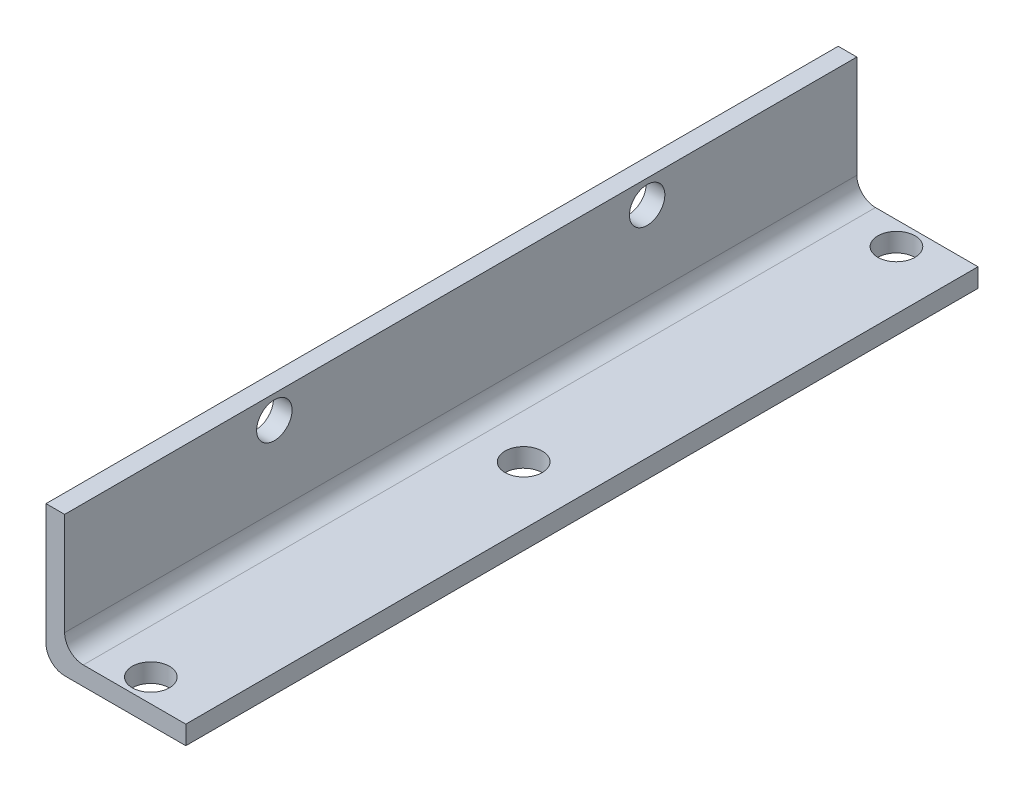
ISO-10303-21;
HEADER;
FILE_DESCRIPTION(('STEP AP214'),'2;1');
FILE_NAME('part.step','',(''),(''),'','','');
FILE_SCHEMA(('AUTOMOTIVE_DESIGN { 1 0 10303 214 1 1 1 1 }'));
ENDSEC;
DATA;
#1=APPLICATION_CONTEXT('core data for automotive mechanical design processes');
#2=APPLICATION_PROTOCOL_DEFINITION('international standard','automotive_design',2000,#1);
#3=PRODUCT_CONTEXT('',#1,'mechanical');
#4=PRODUCT('Part','Part','',(#3));
#5=PRODUCT_RELATED_PRODUCT_CATEGORY('part','',(#4));
#6=PRODUCT_DEFINITION_FORMATION('','',#4);
#7=PRODUCT_DEFINITION_CONTEXT('part definition',#1,'design');
#8=PRODUCT_DEFINITION('design','',#6,#7);
#9=PRODUCT_DEFINITION_SHAPE('','',#8);
#10=(LENGTH_UNIT() NAMED_UNIT(*) SI_UNIT(.MILLI.,.METRE.));
#11=(NAMED_UNIT(*) PLANE_ANGLE_UNIT() SI_UNIT($,.RADIAN.));
#12=(NAMED_UNIT(*) SI_UNIT($,.STERADIAN.) SOLID_ANGLE_UNIT());
#13=UNCERTAINTY_MEASURE_WITH_UNIT(LENGTH_MEASURE(1.E-05),#10,'distance_accuracy_value','');
#14=(GEOMETRIC_REPRESENTATION_CONTEXT(3) GLOBAL_UNCERTAINTY_ASSIGNED_CONTEXT((#13)) GLOBAL_UNIT_ASSIGNED_CONTEXT((#10,
#11,#12)) REPRESENTATION_CONTEXT('',''));
#15=CARTESIAN_POINT('',(0.,0.,0.));
#16=DIRECTION('',(0.,0.,1.));
#17=DIRECTION('',(1.,0.,0.));
#18=AXIS2_PLACEMENT_3D('',#15,#16,#17);
#19=CARTESIAN_POINT('',(0.,38.1,107.95));
#20=DIRECTION('',(1.,0.,0.));
#21=DIRECTION('',(0.,1.,0.));
#22=AXIS2_PLACEMENT_3D('',#19,#20,#21);
#23=PLANE('',#22);
#24=DIRECTION('',(0.,-1.,0.));
#25=VECTOR('',#24,1.);
#26=CARTESIAN_POINT('',(0.,38.1,-107.95));
#27=LINE('',#26,#25);
#28=CARTESIAN_POINT('',(0.,38.1,-107.95));
#29=VERTEX_POINT('',#28);
#30=CARTESIAN_POINT('',(0.,5.08000000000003,-107.95));
#31=VERTEX_POINT('',#30);
#32=EDGE_CURVE('E99',#29,#31,#27,.T.);
#33=ORIENTED_EDGE('',*,*,#32,.T.);
#34=DIRECTION('',(0.,0.,-1.));
#35=VECTOR('',#34,1.);
#36=CARTESIAN_POINT('',(0.,5.08000000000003,107.95));
#37=LINE('',#36,#35);
#38=CARTESIAN_POINT('',(0.,5.08000000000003,107.95));
#39=VERTEX_POINT('',#38);
#40=EDGE_CURVE('E42',#39,#31,#37,.T.);
#41=ORIENTED_EDGE('',*,*,#40,.F.);
#42=DIRECTION('',(0.,-1.,0.));
#43=VECTOR('',#42,1.);
#44=CARTESIAN_POINT('',(0.,38.1,107.95));
#45=LINE('',#44,#43);
#46=CARTESIAN_POINT('',(0.,38.1,107.95));
#47=VERTEX_POINT('',#46);
#48=EDGE_CURVE('E112',#47,#39,#45,.T.);
#49=ORIENTED_EDGE('',*,*,#48,.F.);
#50=DIRECTION('',(0.,0.,-1.));
#51=VECTOR('',#50,1.);
#52=CARTESIAN_POINT('',(0.,38.1,107.95));
#53=LINE('',#52,#51);
#54=EDGE_CURVE('E11',#47,#29,#53,.T.);
#55=ORIENTED_EDGE('',*,*,#54,.T.);
#56=EDGE_LOOP('',(#33,#41,#49,#55));
#57=FACE_BOUND('',#56,.T.);
#58=CARTESIAN_POINT('',(0.,31.75,50.8));
#59=DIRECTION('',(1.,0.,0.));
#60=DIRECTION('',(0.,1.,0.));
#61=AXIS2_PLACEMENT_3D('',#58,#59,#60);
#62=CIRCLE('',#61,4.826);
#63=CARTESIAN_POINT('',(0.,36.576,50.8));
#64=VERTEX_POINT('',#63);
#65=EDGE_CURVE('E117',#64,#64,#62,.T.);
#66=ORIENTED_EDGE('',*,*,#65,.T.);
#67=EDGE_LOOP('',(#66));
#68=FACE_BOUND('',#67,.T.);
#69=CARTESIAN_POINT('',(0.,31.75,-50.8));
#70=DIRECTION('',(-1.,0.,0.));
#71=DIRECTION('',(0.,1.,0.));
#72=AXIS2_PLACEMENT_3D('',#69,#70,#71);
#73=CIRCLE('',#72,4.826);
#74=CARTESIAN_POINT('',(0.,36.576,-50.8));
#75=VERTEX_POINT('',#74);
#76=EDGE_CURVE('E197',#75,#75,#73,.T.);
#77=ORIENTED_EDGE('',*,*,#76,.F.);
#78=EDGE_LOOP('',(#77));
#79=FACE_BOUND('',#78,.T.);
#80=ADVANCED_FACE('F34',(#57,#68,#79),#23,.F.);
#81=CARTESIAN_POINT('',(5.08,10.188585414,107.95));
#82=DIRECTION('',(-1.,0.,0.));
#83=DIRECTION('',(0.,-1.,0.));
#84=AXIS2_PLACEMENT_3D('',#81,#82,#83);
#85=PLANE('',#84);
#86=DIRECTION('',(0.,1.,0.));
#87=VECTOR('',#86,1.);
#88=CARTESIAN_POINT('',(5.08,10.188585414,-107.95));
#89=LINE('',#88,#87);
#90=CARTESIAN_POINT('',(5.08,10.188585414,-107.95));
#91=VERTEX_POINT('',#90);
#92=CARTESIAN_POINT('',(5.08,38.1,-107.95));
#93=VERTEX_POINT('',#92);
#94=EDGE_CURVE('E133',#91,#93,#89,.T.);
#95=ORIENTED_EDGE('',*,*,#94,.T.);
#96=DIRECTION('',(0.,0.,-1.));
#97=VECTOR('',#96,1.);
#98=CARTESIAN_POINT('',(5.08,38.1,107.95));
#99=LINE('',#98,#97);
#100=CARTESIAN_POINT('',(5.08,38.1,107.95));
#101=VERTEX_POINT('',#100);
#102=EDGE_CURVE('E116',#101,#93,#99,.T.);
#103=ORIENTED_EDGE('',*,*,#102,.F.);
#104=DIRECTION('',(0.,1.,0.));
#105=VECTOR('',#104,1.);
#106=CARTESIAN_POINT('',(5.08,10.188585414,107.95));
#107=LINE('',#106,#105);
#108=CARTESIAN_POINT('',(5.08,10.188585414,107.95));
#109=VERTEX_POINT('',#108);
#110=EDGE_CURVE('E49',#109,#101,#107,.T.);
#111=ORIENTED_EDGE('',*,*,#110,.F.);
#112=DIRECTION('',(0.,0.,-1.));
#113=VECTOR('',#112,1.);
#114=CARTESIAN_POINT('',(5.08,10.188585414,107.95));
#115=LINE('',#114,#113);
#116=EDGE_CURVE('E149',#109,#91,#115,.T.);
#117=ORIENTED_EDGE('',*,*,#116,.T.);
#118=EDGE_LOOP('',(#95,#103,#111,#117));
#119=FACE_BOUND('',#118,.T.);
#120=CARTESIAN_POINT('',(5.08,31.75,50.8));
#121=DIRECTION('',(1.,0.,0.));
#122=DIRECTION('',(0.,1.,0.));
#123=AXIS2_PLACEMENT_3D('',#120,#121,#122);
#124=CIRCLE('',#123,4.826);
#125=CARTESIAN_POINT('',(5.08,36.576,50.8));
#126=VERTEX_POINT('',#125);
#127=EDGE_CURVE('E120',#126,#126,#124,.T.);
#128=ORIENTED_EDGE('',*,*,#127,.F.);
#129=EDGE_LOOP('',(#128));
#130=FACE_BOUND('',#129,.T.);
#131=CARTESIAN_POINT('',(5.08,31.75,-50.8));
#132=DIRECTION('',(-1.,0.,0.));
#133=DIRECTION('',(0.,1.,0.));
#134=AXIS2_PLACEMENT_3D('',#131,#132,#133);
#135=CIRCLE('',#134,4.826);
#136=CARTESIAN_POINT('',(5.08,36.576,-50.8));
#137=VERTEX_POINT('',#136);
#138=EDGE_CURVE('E195',#137,#137,#135,.T.);
#139=ORIENTED_EDGE('',*,*,#138,.T.);
#140=EDGE_LOOP('',(#139));
#141=FACE_BOUND('',#140,.T.);
#142=ADVANCED_FACE('F186',(#119,#130,#141),#85,.F.);
#143=CARTESIAN_POINT('',(5.08,38.1,107.95));
#144=DIRECTION('',(0.,-1.,0.));
#145=DIRECTION('',(0.,0.,-1.));
#146=AXIS2_PLACEMENT_3D('',#143,#144,#145);
#147=PLANE('',#146);
#148=DIRECTION('',(-1.,0.,0.));
#149=VECTOR('',#148,1.);
#150=CARTESIAN_POINT('',(5.08,38.1,-107.95));
#151=LINE('',#150,#149);
#152=EDGE_CURVE('E103',#93,#29,#151,.T.);
#153=ORIENTED_EDGE('',*,*,#152,.T.);
#154=ORIENTED_EDGE('',*,*,#54,.F.);
#155=DIRECTION('',(-1.,0.,0.));
#156=VECTOR('',#155,1.);
#157=CARTESIAN_POINT('',(5.08,38.1,107.95));
#158=LINE('',#157,#156);
#159=EDGE_CURVE('E135',#101,#47,#158,.T.);
#160=ORIENTED_EDGE('',*,*,#159,.F.);
#161=ORIENTED_EDGE('',*,*,#102,.T.);
#162=EDGE_LOOP('',(#153,#154,#160,#161));
#163=FACE_BOUND('',#162,.T.);
#164=ADVANCED_FACE('F36',(#163),#147,.F.);
#165=CARTESIAN_POINT('',(5.08,5.08,107.95));
#166=DIRECTION('',(0.,0.,-1.));
#167=DIRECTION('',(-1.,0.,0.));
#168=AXIS2_PLACEMENT_3D('',#165,#166,#167);
#169=CYLINDRICAL_SURFACE('',#168,5.08);
#170=CARTESIAN_POINT('',(5.08,5.08,-107.95));
#171=DIRECTION('',(0.,0.,1.));
#172=DIRECTION('',(-1.,0.,0.));
#173=AXIS2_PLACEMENT_3D('',#170,#171,#172);
#174=CIRCLE('',#173,5.08);
#175=CARTESIAN_POINT('',(5.08000000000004,0.,-107.95));
#176=VERTEX_POINT('',#175);
#177=EDGE_CURVE('E105',#31,#176,#174,.T.);
#178=ORIENTED_EDGE('',*,*,#177,.T.);
#179=DIRECTION('',(0.,0.,-1.));
#180=VECTOR('',#179,1.);
#181=CARTESIAN_POINT('',(5.08000000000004,0.,107.95));
#182=LINE('',#181,#180);
#183=CARTESIAN_POINT('',(5.08000000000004,0.,107.95));
#184=VERTEX_POINT('',#183);
#185=EDGE_CURVE('E161',#184,#176,#182,.T.);
#186=ORIENTED_EDGE('',*,*,#185,.F.);
#187=CARTESIAN_POINT('',(5.08,5.08,107.95));
#188=DIRECTION('',(0.,0.,1.));
#189=DIRECTION('',(-1.,0.,0.));
#190=AXIS2_PLACEMENT_3D('',#187,#188,#189);
#191=CIRCLE('',#190,5.08);
#192=EDGE_CURVE('E138',#39,#184,#191,.T.);
#193=ORIENTED_EDGE('',*,*,#192,.F.);
#194=ORIENTED_EDGE('',*,*,#40,.T.);
#195=EDGE_LOOP('',(#178,#186,#193,#194));
#196=FACE_BOUND('',#195,.T.);
#197=ADVANCED_FACE('F165',(#196),#169,.T.);
#198=CARTESIAN_POINT('',(5.08000000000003,0.,107.95));
#199=DIRECTION('',(0.,1.,0.));
#200=DIRECTION('',(0.,0.,1.));
#201=AXIS2_PLACEMENT_3D('',#198,#199,#200);
#202=PLANE('',#201);
#203=CARTESIAN_POINT('',(22.225,0.,101.6));
#204=DIRECTION('',(0.,1.,0.));
#205=DIRECTION('',(-1.,0.,0.));
#206=AXIS2_PLACEMENT_3D('',#203,#204,#205);
#207=CIRCLE('',#206,5.08);
#208=CARTESIAN_POINT('',(17.145,0.,101.6));
#209=VERTEX_POINT('',#208);
#210=EDGE_CURVE('E318',#209,#209,#207,.T.);
#211=ORIENTED_EDGE('',*,*,#210,.T.);
#212=EDGE_LOOP('',(#211));
#213=FACE_BOUND('',#212,.T.);
#214=CARTESIAN_POINT('',(22.225,0.,-101.6));
#215=DIRECTION('',(0.,1.,0.));
#216=DIRECTION('',(-1.,0.,0.));
#217=AXIS2_PLACEMENT_3D('',#214,#215,#216);
#218=CIRCLE('',#217,5.08);
#219=CARTESIAN_POINT('',(17.145,0.,-101.6));
#220=VERTEX_POINT('',#219);
#221=EDGE_CURVE('E322',#220,#220,#218,.T.);
#222=ORIENTED_EDGE('',*,*,#221,.T.);
#223=EDGE_LOOP('',(#222));
#224=FACE_BOUND('',#223,.T.);
#225=CARTESIAN_POINT('',(22.225,0.,0.));
#226=DIRECTION('',(0.,1.,0.));
#227=DIRECTION('',(-1.,0.,0.));
#228=AXIS2_PLACEMENT_3D('',#225,#226,#227);
#229=CIRCLE('',#228,5.08);
#230=CARTESIAN_POINT('',(17.145,0.,0.));
#231=VERTEX_POINT('',#230);
#232=EDGE_CURVE('E198',#231,#231,#229,.T.);
#233=ORIENTED_EDGE('',*,*,#232,.T.);
#234=EDGE_LOOP('',(#233));
#235=FACE_BOUND('',#234,.T.);
#236=DIRECTION('',(1.,0.,0.));
#237=VECTOR('',#236,1.);
#238=CARTESIAN_POINT('',(5.08000000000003,0.,-107.95));
#239=LINE('',#238,#237);
#240=CARTESIAN_POINT('',(38.1,0.,-107.95));
#241=VERTEX_POINT('',#240);
#242=EDGE_CURVE('E125',#176,#241,#239,.T.);
#243=ORIENTED_EDGE('',*,*,#242,.T.);
#244=DIRECTION('',(0.,0.,-1.));
#245=VECTOR('',#244,1.);
#246=CARTESIAN_POINT('',(38.1,0.,107.95));
#247=LINE('',#246,#245);
#248=CARTESIAN_POINT('',(38.1,0.,107.95));
#249=VERTEX_POINT('',#248);
#250=EDGE_CURVE('E158',#249,#241,#247,.T.);
#251=ORIENTED_EDGE('',*,*,#250,.F.);
#252=DIRECTION('',(1.,0.,0.));
#253=VECTOR('',#252,1.);
#254=CARTESIAN_POINT('',(5.08000000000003,0.,107.95));
#255=LINE('',#254,#253);
#256=EDGE_CURVE('E140',#184,#249,#255,.T.);
#257=ORIENTED_EDGE('',*,*,#256,.F.);
#258=ORIENTED_EDGE('',*,*,#185,.T.);
#259=EDGE_LOOP('',(#243,#251,#257,#258));
#260=FACE_BOUND('',#259,.T.);
#261=ADVANCED_FACE('F173',(#213,#224,#235,#260),#202,.F.);
#262=CARTESIAN_POINT('',(38.1,0.,107.95));
#263=DIRECTION('',(-1.,0.,0.));
#264=DIRECTION('',(0.,0.,1.));
#265=AXIS2_PLACEMENT_3D('',#262,#263,#264);
#266=PLANE('',#265);
#267=DIRECTION('',(0.,1.,0.));
#268=VECTOR('',#267,1.);
#269=CARTESIAN_POINT('',(38.1,0.,-107.95));
#270=LINE('',#269,#268);
#271=CARTESIAN_POINT('',(38.1,5.108585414,-107.95));
#272=VERTEX_POINT('',#271);
#273=EDGE_CURVE('E127',#241,#272,#270,.T.);
#274=ORIENTED_EDGE('',*,*,#273,.T.);
#275=DIRECTION('',(0.,0.,-1.));
#276=VECTOR('',#275,1.);
#277=CARTESIAN_POINT('',(38.1,5.108585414,107.95));
#278=LINE('',#277,#276);
#279=CARTESIAN_POINT('',(38.1,5.108585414,107.95));
#280=VERTEX_POINT('',#279);
#281=EDGE_CURVE('E155',#280,#272,#278,.T.);
#282=ORIENTED_EDGE('',*,*,#281,.F.);
#283=DIRECTION('',(0.,1.,0.));
#284=VECTOR('',#283,1.);
#285=CARTESIAN_POINT('',(38.1,0.,107.95));
#286=LINE('',#285,#284);
#287=EDGE_CURVE('E142',#249,#280,#286,.T.);
#288=ORIENTED_EDGE('',*,*,#287,.F.);
#289=ORIENTED_EDGE('',*,*,#250,.T.);
#290=EDGE_LOOP('',(#274,#282,#288,#289));
#291=FACE_BOUND('',#290,.T.);
#292=ADVANCED_FACE('F176',(#291),#266,.F.);
#293=CARTESIAN_POINT('',(38.1,5.108585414,107.95));
#294=DIRECTION('',(0.,-1.,0.));
#295=DIRECTION('',(1.,0.,0.));
#296=AXIS2_PLACEMENT_3D('',#293,#294,#295);
#297=PLANE('',#296);
#298=CARTESIAN_POINT('',(22.225,5.108585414,101.6));
#299=DIRECTION('',(0.,1.,0.));
#300=DIRECTION('',(-1.,0.,0.));
#301=AXIS2_PLACEMENT_3D('',#298,#299,#300);
#302=CIRCLE('',#301,5.08);
#303=CARTESIAN_POINT('',(17.145,5.108585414,101.6));
#304=VERTEX_POINT('',#303);
#305=EDGE_CURVE('E321',#304,#304,#302,.T.);
#306=ORIENTED_EDGE('',*,*,#305,.F.);
#307=EDGE_LOOP('',(#306));
#308=FACE_BOUND('',#307,.T.);
#309=CARTESIAN_POINT('',(22.225,5.108585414,-101.6));
#310=DIRECTION('',(0.,1.,0.));
#311=DIRECTION('',(-1.,0.,0.));
#312=AXIS2_PLACEMENT_3D('',#309,#310,#311);
#313=CIRCLE('',#312,5.08);
#314=CARTESIAN_POINT('',(17.145,5.108585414,-101.6));
#315=VERTEX_POINT('',#314);
#316=EDGE_CURVE('E325',#315,#315,#313,.T.);
#317=ORIENTED_EDGE('',*,*,#316,.F.);
#318=EDGE_LOOP('',(#317));
#319=FACE_BOUND('',#318,.T.);
#320=CARTESIAN_POINT('',(22.225,5.108585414,0.));
#321=DIRECTION('',(0.,1.,0.));
#322=DIRECTION('',(-1.,0.,0.));
#323=AXIS2_PLACEMENT_3D('',#320,#321,#322);
#324=CIRCLE('',#323,5.08);
#325=CARTESIAN_POINT('',(17.145,5.108585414,0.));
#326=VERTEX_POINT('',#325);
#327=EDGE_CURVE('E203',#326,#326,#324,.T.);
#328=ORIENTED_EDGE('',*,*,#327,.F.);
#329=EDGE_LOOP('',(#328));
#330=FACE_BOUND('',#329,.T.);
#331=DIRECTION('',(-1.,0.,0.));
#332=VECTOR('',#331,1.);
#333=CARTESIAN_POINT('',(38.1,5.108585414,-107.95));
#334=LINE('',#333,#332);
#335=CARTESIAN_POINT('',(10.16,5.108585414,-107.95));
#336=VERTEX_POINT('',#335);
#337=EDGE_CURVE('E129',#272,#336,#334,.T.);
#338=ORIENTED_EDGE('',*,*,#337,.T.);
#339=DIRECTION('',(0.,0.,-1.));
#340=VECTOR('',#339,1.);
#341=CARTESIAN_POINT('',(10.16,5.108585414,107.95));
#342=LINE('',#341,#340);
#343=CARTESIAN_POINT('',(10.16,5.108585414,107.95));
#344=VERTEX_POINT('',#343);
#345=EDGE_CURVE('E152',#344,#336,#342,.T.);
#346=ORIENTED_EDGE('',*,*,#345,.F.);
#347=DIRECTION('',(-1.,0.,0.));
#348=VECTOR('',#347,1.);
#349=CARTESIAN_POINT('',(38.1,5.108585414,107.95));
#350=LINE('',#349,#348);
#351=EDGE_CURVE('E144',#280,#344,#350,.T.);
#352=ORIENTED_EDGE('',*,*,#351,.F.);
#353=ORIENTED_EDGE('',*,*,#281,.T.);
#354=EDGE_LOOP('',(#338,#346,#352,#353));
#355=FACE_BOUND('',#354,.T.);
#356=ADVANCED_FACE('F181',(#308,#319,#330,#355),#297,.F.);
#357=CARTESIAN_POINT('',(10.16,10.188585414,107.95));
#358=DIRECTION('',(0.,0.,-1.));
#359=DIRECTION('',(-1.,0.,0.));
#360=AXIS2_PLACEMENT_3D('',#357,#358,#359);
#361=CYLINDRICAL_SURFACE('',#360,5.08);
#362=CARTESIAN_POINT('',(10.16,10.188585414,-107.95));
#363=DIRECTION('',(0.,0.,-1.));
#364=DIRECTION('',(-1.,0.,0.));
#365=AXIS2_PLACEMENT_3D('',#362,#363,#364);
#366=CIRCLE('',#365,5.08);
#367=EDGE_CURVE('E131',#336,#91,#366,.T.);
#368=ORIENTED_EDGE('',*,*,#367,.T.);
#369=ORIENTED_EDGE('',*,*,#116,.F.);
#370=CARTESIAN_POINT('',(10.16,10.188585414,107.95));
#371=DIRECTION('',(0.,0.,-1.));
#372=DIRECTION('',(-1.,0.,0.));
#373=AXIS2_PLACEMENT_3D('',#370,#371,#372);
#374=CIRCLE('',#373,5.08);
#375=EDGE_CURVE('E54',#344,#109,#374,.T.);
#376=ORIENTED_EDGE('',*,*,#375,.F.);
#377=ORIENTED_EDGE('',*,*,#345,.T.);
#378=EDGE_LOOP('',(#368,#369,#376,#377));
#379=FACE_BOUND('',#378,.T.);
#380=ADVANCED_FACE('F184',(#379),#361,.F.);
#381=CARTESIAN_POINT('',(5.08,5.08,107.95));
#382=DIRECTION('',(0.,0.,-1.));
#383=DIRECTION('',(-1.,0.,0.));
#384=AXIS2_PLACEMENT_3D('',#381,#382,#383);
#385=PLANE('',#384);
#386=ORIENTED_EDGE('',*,*,#159,.T.);
#387=ORIENTED_EDGE('',*,*,#48,.T.);
#388=ORIENTED_EDGE('',*,*,#192,.T.);
#389=ORIENTED_EDGE('',*,*,#256,.T.);
#390=ORIENTED_EDGE('',*,*,#287,.T.);
#391=ORIENTED_EDGE('',*,*,#351,.T.);
#392=ORIENTED_EDGE('',*,*,#375,.T.);
#393=ORIENTED_EDGE('',*,*,#110,.T.);
#394=EDGE_LOOP('',(#386,#387,#388,#389,#390,#391,#392,#393));
#395=FACE_BOUND('',#394,.T.);
#396=ADVANCED_FACE('F168',(#395),#385,.F.);
#397=CARTESIAN_POINT('',(5.08,5.08,-107.95));
#398=DIRECTION('',(0.,0.,-1.));
#399=DIRECTION('',(-1.,0.,0.));
#400=AXIS2_PLACEMENT_3D('',#397,#398,#399);
#401=PLANE('',#400);
#402=ORIENTED_EDGE('',*,*,#152,.F.);
#403=ORIENTED_EDGE('',*,*,#94,.F.);
#404=ORIENTED_EDGE('',*,*,#367,.F.);
#405=ORIENTED_EDGE('',*,*,#337,.F.);
#406=ORIENTED_EDGE('',*,*,#273,.F.);
#407=ORIENTED_EDGE('',*,*,#242,.F.);
#408=ORIENTED_EDGE('',*,*,#177,.F.);
#409=ORIENTED_EDGE('',*,*,#32,.F.);
#410=EDGE_LOOP('',(#402,#403,#404,#405,#406,#407,#408,#409));
#411=FACE_BOUND('',#410,.T.);
#412=ADVANCED_FACE('F100',(#411),#401,.T.);
#413=CARTESIAN_POINT('',(0.,31.75,50.8));
#414=DIRECTION('',(1.,0.,0.));
#415=DIRECTION('',(0.,1.,0.));
#416=AXIS2_PLACEMENT_3D('',#413,#414,#415);
#417=CYLINDRICAL_SURFACE('',#416,4.826);
#418=ORIENTED_EDGE('',*,*,#65,.F.);
#419=EDGE_LOOP('',(#418));
#420=FACE_BOUND('',#419,.T.);
#421=ORIENTED_EDGE('',*,*,#127,.T.);
#422=EDGE_LOOP('',(#421));
#423=FACE_BOUND('',#422,.T.);
#424=ADVANCED_FACE('F207',(#420,#423),#417,.F.);
#425=CARTESIAN_POINT('',(0.,31.75,-50.8));
#426=DIRECTION('',(1.,0.,0.));
#427=DIRECTION('',(0.,1.,0.));
#428=AXIS2_PLACEMENT_3D('',#425,#426,#427);
#429=CYLINDRICAL_SURFACE('',#428,4.826);
#430=ORIENTED_EDGE('',*,*,#76,.T.);
#431=EDGE_LOOP('',(#430));
#432=FACE_BOUND('',#431,.T.);
#433=ORIENTED_EDGE('',*,*,#138,.F.);
#434=EDGE_LOOP('',(#433));
#435=FACE_BOUND('',#434,.T.);
#436=ADVANCED_FACE('F209',(#432,#435),#429,.F.);
#437=CARTESIAN_POINT('',(22.225,0.,0.));
#438=DIRECTION('',(0.,1.,0.));
#439=DIRECTION('',(-1.,0.,0.));
#440=AXIS2_PLACEMENT_3D('',#437,#438,#439);
#441=CYLINDRICAL_SURFACE('',#440,5.08);
#442=ORIENTED_EDGE('',*,*,#232,.F.);
#443=EDGE_LOOP('',(#442));
#444=FACE_BOUND('',#443,.T.);
#445=ORIENTED_EDGE('',*,*,#327,.T.);
#446=EDGE_LOOP('',(#445));
#447=FACE_BOUND('',#446,.T.);
#448=ADVANCED_FACE('F216',(#444,#447),#441,.F.);
#449=CARTESIAN_POINT('',(22.225,0.,-101.6));
#450=DIRECTION('',(0.,1.,0.));
#451=DIRECTION('',(-1.,0.,0.));
#452=AXIS2_PLACEMENT_3D('',#449,#450,#451);
#453=CYLINDRICAL_SURFACE('',#452,5.08);
#454=ORIENTED_EDGE('',*,*,#221,.F.);
#455=EDGE_LOOP('',(#454));
#456=FACE_BOUND('',#455,.T.);
#457=ORIENTED_EDGE('',*,*,#316,.T.);
#458=EDGE_LOOP('',(#457));
#459=FACE_BOUND('',#458,.T.);
#460=ADVANCED_FACE('F276',(#456,#459),#453,.F.);
#461=CARTESIAN_POINT('',(22.225,0.,101.6));
#462=DIRECTION('',(0.,1.,0.));
#463=DIRECTION('',(-1.,0.,0.));
#464=AXIS2_PLACEMENT_3D('',#461,#462,#463);
#465=CYLINDRICAL_SURFACE('',#464,5.08);
#466=ORIENTED_EDGE('',*,*,#210,.F.);
#467=EDGE_LOOP('',(#466));
#468=FACE_BOUND('',#467,.T.);
#469=ORIENTED_EDGE('',*,*,#305,.T.);
#470=EDGE_LOOP('',(#469));
#471=FACE_BOUND('',#470,.T.);
#472=ADVANCED_FACE('F286',(#468,#471),#465,.F.);
#473=CLOSED_SHELL('',(#80,#142,#164,#197,#261,#292,#356,#380,#396,#412,#424,#436,#448,#460,#472));
#474=MANIFOLD_SOLID_BREP('B2',#473);
#475=ADVANCED_BREP_SHAPE_REPRESENTATION('',(#18,#474),#14);
#476=SHAPE_DEFINITION_REPRESENTATION(#9,#475);
ENDSEC;
END-ISO-10303-21;
